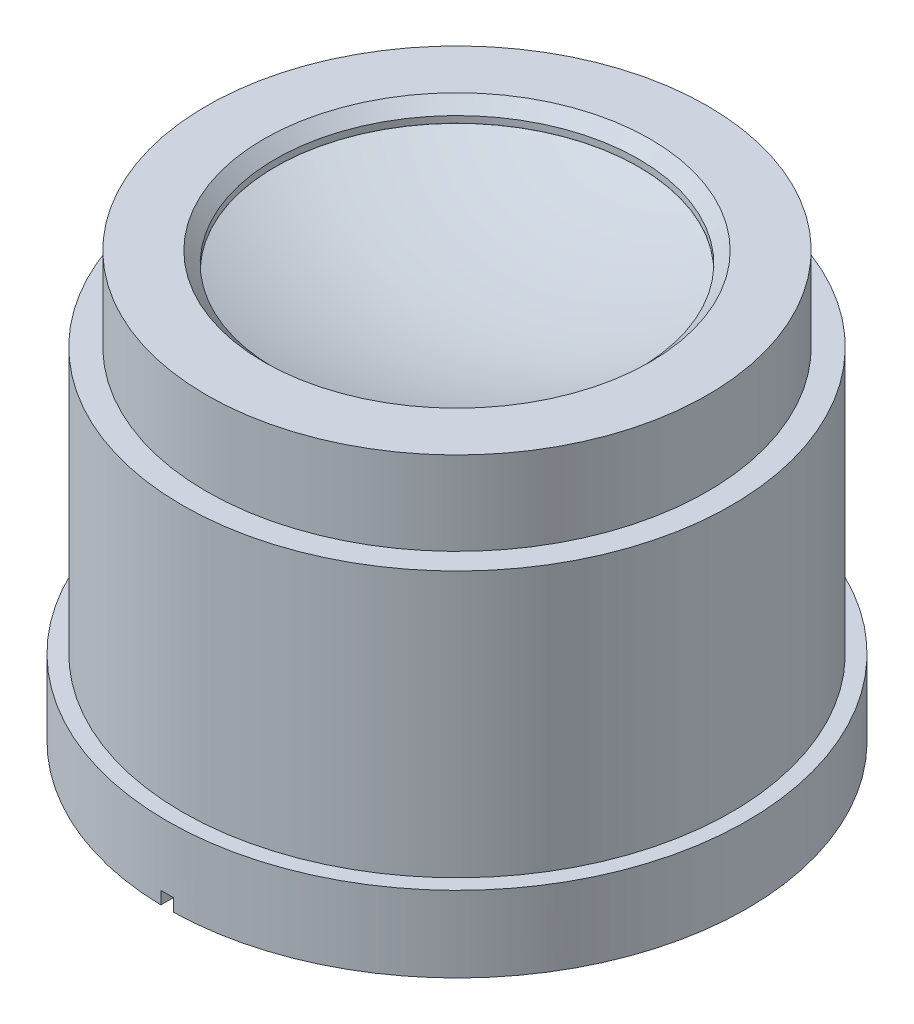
ISO-10303-21;
HEADER;
FILE_DESCRIPTION(('STEP AP214'),'2;1');
FILE_NAME('part.step','',(''),(''),'','','');
FILE_SCHEMA(('AUTOMOTIVE_DESIGN { 1 0 10303 214 1 1 1 1 }'));
ENDSEC;
DATA;
#1=APPLICATION_CONTEXT('core data for automotive mechanical design processes');
#2=APPLICATION_PROTOCOL_DEFINITION('international standard','automotive_design',2000,#1);
#3=PRODUCT_CONTEXT('',#1,'mechanical');
#4=PRODUCT('Part','Part','',(#3));
#5=PRODUCT_RELATED_PRODUCT_CATEGORY('part','',(#4));
#6=PRODUCT_DEFINITION_FORMATION('','',#4);
#7=PRODUCT_DEFINITION_CONTEXT('part definition',#1,'design');
#8=PRODUCT_DEFINITION('design','',#6,#7);
#9=PRODUCT_DEFINITION_SHAPE('','',#8);
#10=(LENGTH_UNIT() NAMED_UNIT(*) SI_UNIT(.MILLI.,.METRE.));
#11=(NAMED_UNIT(*) PLANE_ANGLE_UNIT() SI_UNIT($,.RADIAN.));
#12=(NAMED_UNIT(*) SI_UNIT($,.STERADIAN.) SOLID_ANGLE_UNIT());
#13=UNCERTAINTY_MEASURE_WITH_UNIT(LENGTH_MEASURE(1.E-05),#10,'distance_accuracy_value','');
#14=(GEOMETRIC_REPRESENTATION_CONTEXT(3) GLOBAL_UNCERTAINTY_ASSIGNED_CONTEXT((#13)) GLOBAL_UNIT_ASSIGNED_CONTEXT((#10,
#11,#12)) REPRESENTATION_CONTEXT('',''));
#15=CARTESIAN_POINT('',(0.,0.,0.));
#16=DIRECTION('',(0.,0.,1.));
#17=DIRECTION('',(1.,0.,0.));
#18=AXIS2_PLACEMENT_3D('',#15,#16,#17);
#19=CARTESIAN_POINT('',(-145.850201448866,42.7391679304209,80.4269664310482));
#20=DIRECTION('',(0.,-1.,0.));
#21=DIRECTION('',(0.,0.,-1.));
#22=AXIS2_PLACEMENT_3D('',#19,#20,#21);
#23=CYLINDRICAL_SURFACE('',#22,11.9634);
#24=CARTESIAN_POINT('',(-145.850201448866,7.69506286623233,80.4269664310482));
#25=DIRECTION('',(0.,1.,0.));
#26=DIRECTION('',(0.,0.,1.));
#27=AXIS2_PLACEMENT_3D('',#24,#25,#26);
#28=CIRCLE('',#27,11.9634);
#29=CARTESIAN_POINT('',(-145.850201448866,7.69506286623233,92.3903664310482));
#30=VERTEX_POINT('',#29);
#31=EDGE_CURVE('P0_E10',#30,#30,#28,.T.);
#32=ORIENTED_EDGE('',*,*,#31,.T.);
#33=EDGE_LOOP('',(#32));
#34=FACE_BOUND('',#33,.T.);
#35=CARTESIAN_POINT('',(-145.850201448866,7.70776286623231,80.4269664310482));
#36=DIRECTION('',(0.,1.,0.));
#37=DIRECTION('',(0.,0.,1.));
#38=AXIS2_PLACEMENT_3D('',#35,#36,#37);
#39=CIRCLE('',#38,11.9634);
#40=CARTESIAN_POINT('',(-145.850201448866,7.70776286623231,92.3903664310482));
#41=VERTEX_POINT('',#40);
#42=EDGE_CURVE('P0_E28',#41,#41,#39,.T.);
#43=ORIENTED_EDGE('',*,*,#42,.F.);
#44=EDGE_LOOP('',(#43));
#45=FACE_BOUND('',#44,.T.);
#46=ADVANCED_FACE('P0_F14',(#34,#45),#23,.T.);
#47=CARTESIAN_POINT('',(-145.850201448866,37.8562928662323,80.4269664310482));
#48=DIRECTION('',(0.,0.,1.));
#49=DIRECTION('',(1.,0.,0.));
#50=AXIS2_PLACEMENT_3D('',#47,#48,#49);
#51=SPHERICAL_SURFACE('',#50,32.44723);
#52=CARTESIAN_POINT('',(-145.850201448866,37.8562928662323,80.4269664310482));
#53=DIRECTION('',(0.,1.,0.));
#54=DIRECTION('',(0.,0.,1.));
#55=AXIS2_PLACEMENT_3D('',#52,#53,#54);
#56=SPHERICAL_SURFACE('',#55,32.44723);
#57=ORIENTED_EDGE('',*,*,#31,.F.);
#58=EDGE_LOOP('',(#57));
#59=FACE_BOUND('',#58,.T.);
#60=ADVANCED_FACE('P0_F16',(#59),#56,.T.);
#61=CARTESIAN_POINT('',(-145.850201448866,7.70776286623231,80.4269664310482));
#62=DIRECTION('',(0.,1.,0.));
#63=DIRECTION('',(0.,0.,1.));
#64=AXIS2_PLACEMENT_3D('',#61,#62,#63);
#65=PLANE('',#64);
#66=CARTESIAN_POINT('',(-145.850201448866,7.70776286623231,80.4269664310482));
#67=DIRECTION('',(0.,1.,0.));
#68=DIRECTION('',(0.,0.,1.));
#69=AXIS2_PLACEMENT_3D('',#66,#67,#68);
#70=CIRCLE('',#69,11.96086);
#71=CARTESIAN_POINT('',(-145.850201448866,7.70776286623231,92.3878264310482));
#72=VERTEX_POINT('',#71);
#73=EDGE_CURVE('P0_E18',#72,#72,#70,.T.);
#74=ORIENTED_EDGE('',*,*,#73,.F.);
#75=EDGE_LOOP('',(#74));
#76=FACE_BOUND('',#75,.T.);
#77=ORIENTED_EDGE('',*,*,#42,.T.);
#78=EDGE_LOOP('',(#77));
#79=FACE_BOUND('',#78,.T.);
#80=ADVANCED_FACE('P0_F37',(#76,#79),#65,.T.);
#81=CARTESIAN_POINT('',(-145.850201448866,37.8562928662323,80.4269664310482));
#82=DIRECTION('',(0.,0.,1.));
#83=DIRECTION('',(1.,0.,0.));
#84=AXIS2_PLACEMENT_3D('',#81,#82,#83);
#85=SPHERICAL_SURFACE('',#84,32.44469);
#86=CARTESIAN_POINT('',(-145.850201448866,37.8562928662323,80.4269664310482));
#87=DIRECTION('',(0.,1.,0.));
#88=DIRECTION('',(0.,0.,1.));
#89=AXIS2_PLACEMENT_3D('',#86,#87,#88);
#90=SPHERICAL_SURFACE('',#89,32.44469);
#91=CARTESIAN_POINT('',(-145.850201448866,7.69678794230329,80.4269664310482));
#92=DIRECTION('',(0.,1.,0.));
#93=DIRECTION('',(0.,0.,1.));
#94=AXIS2_PLACEMENT_3D('',#91,#92,#93);
#95=CIRCLE('',#94,11.96086);
#96=CARTESIAN_POINT('',(-145.850201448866,7.69678794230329,92.3878264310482));
#97=VERTEX_POINT('',#96);
#98=EDGE_CURVE('P0_E22',#97,#97,#95,.T.);
#99=ORIENTED_EDGE('',*,*,#98,.T.);
#100=EDGE_LOOP('',(#99));
#101=FACE_BOUND('',#100,.T.);
#102=ADVANCED_FACE('P0_F39',(#101),#90,.F.);
#103=CARTESIAN_POINT('',(-145.850201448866,42.7391679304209,80.4269664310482));
#104=DIRECTION('',(0.,-1.,0.));
#105=DIRECTION('',(0.,0.,-1.));
#106=AXIS2_PLACEMENT_3D('',#103,#104,#105);
#107=CYLINDRICAL_SURFACE('',#106,11.96086);
#108=ORIENTED_EDGE('',*,*,#98,.F.);
#109=EDGE_LOOP('',(#108));
#110=FACE_BOUND('',#109,.T.);
#111=ORIENTED_EDGE('',*,*,#73,.T.);
#112=EDGE_LOOP('',(#111));
#113=FACE_BOUND('',#112,.T.);
#114=ADVANCED_FACE('P0_F35',(#110,#113),#107,.F.);
#115=CLOSED_SHELL('',(#46,#60,#80,#102,#114));
#116=MANIFOLD_SOLID_BREP('P0_B1',#115);
#117=CARTESIAN_POINT('',(-145.850201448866,-19.0984371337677,80.4269664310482));
#118=DIRECTION('',(0.,1.,0.));
#119=DIRECTION('',(0.,0.,1.));
#120=AXIS2_PLACEMENT_3D('',#117,#118,#119);
#121=PLANE('',#120);
#122=CARTESIAN_POINT('',(-145.850201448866,-19.0984371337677,80.4269664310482));
#123=DIRECTION('',(0.,1.,0.));
#124=DIRECTION('',(0.,0.,1.));
#125=AXIS2_PLACEMENT_3D('',#122,#123,#124);
#126=CIRCLE('',#125,19.100000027);
#127=CARTESIAN_POINT('',(-146.269301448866,-19.0984371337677,61.3315649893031));
#128=VERTEX_POINT('',#127);
#129=CARTESIAN_POINT('',(-146.269301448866,-19.0984371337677,99.5223678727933));
#130=VERTEX_POINT('',#129);
#131=EDGE_CURVE('P1_E103',#128,#130,#126,.T.);
#132=ORIENTED_EDGE('',*,*,#131,.F.);
#133=DIRECTION('',(0.,0.,1.));
#134=VECTOR('',#133,1.);
#135=CARTESIAN_POINT('',(-146.269301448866,-19.0984371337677,61.3269664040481));
#136=LINE('',#135,#134);
#137=CARTESIAN_POINT('',(-146.269301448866,-19.0984371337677,63.1346443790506));
#138=VERTEX_POINT('',#137);
#139=EDGE_CURVE('P1_E174',#128,#138,#136,.T.);
#140=ORIENTED_EDGE('',*,*,#139,.T.);
#141=CARTESIAN_POINT('',(-145.850201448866,-19.0984371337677,80.4269664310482));
#142=DIRECTION('',(0.,1.,0.));
#143=DIRECTION('',(0.,0.,1.));
#144=AXIS2_PLACEMENT_3D('',#141,#142,#143);
#145=CIRCLE('',#144,17.2974);
#146=CARTESIAN_POINT('',(-146.269301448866,-19.0984371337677,97.7192884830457));
#147=VERTEX_POINT('',#146);
#148=EDGE_CURVE('P1_E106',#138,#147,#145,.T.);
#149=ORIENTED_EDGE('',*,*,#148,.T.);
#150=EDGE_CURVE('P1_E175',#147,#130,#136,.T.);
#151=ORIENTED_EDGE('',*,*,#150,.T.);
#152=EDGE_LOOP('',(#132,#140,#149,#151));
#153=FACE_BOUND('',#152,.T.);
#154=ADVANCED_FACE('P1_F16',(#153),#121,.F.);
#155=CARTESIAN_POINT('',(-145.431101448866,-19.0984371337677,99.5223678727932));
#156=VERTEX_POINT('',#155);
#157=CARTESIAN_POINT('',(-145.431101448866,-19.0984371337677,61.3315649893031));
#158=VERTEX_POINT('',#157);
#159=EDGE_CURVE('P1_E95',#156,#158,#126,.T.);
#160=ORIENTED_EDGE('',*,*,#159,.F.);
#161=DIRECTION('',(0.,0.,1.));
#162=VECTOR('',#161,1.);
#163=CARTESIAN_POINT('',(-145.431101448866,-19.0984371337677,61.3269664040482));
#164=LINE('',#163,#162);
#165=CARTESIAN_POINT('',(-145.431101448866,-19.0984371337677,97.7192884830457));
#166=VERTEX_POINT('',#165);
#167=EDGE_CURVE('P1_E98',#166,#156,#164,.T.);
#168=ORIENTED_EDGE('',*,*,#167,.F.);
#169=CARTESIAN_POINT('',(-145.431101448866,-19.0984371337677,63.1346443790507));
#170=VERTEX_POINT('',#169);
#171=EDGE_CURVE('P1_E97',#166,#170,#145,.T.);
#172=ORIENTED_EDGE('',*,*,#171,.T.);
#173=EDGE_CURVE('P1_E39',#158,#170,#164,.T.);
#174=ORIENTED_EDGE('',*,*,#173,.F.);
#175=EDGE_LOOP('',(#160,#168,#172,#174));
#176=FACE_BOUND('',#175,.T.);
#177=ADVANCED_FACE('P1_F93',(#176),#121,.F.);
#178=CARTESIAN_POINT('',(-145.850201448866,8.90156286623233,80.4269664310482));
#179=DIRECTION('',(0.,1.,0.));
#180=DIRECTION('',(0.,0.,1.));
#181=AXIS2_PLACEMENT_3D('',#178,#179,#180);
#182=CYLINDRICAL_SURFACE('',#181,19.100000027);
#183=CARTESIAN_POINT('',(-145.850201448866,-14.0984371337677,80.4269664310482));
#184=DIRECTION('',(0.,1.,0.));
#185=DIRECTION('',(0.,0.,1.));
#186=AXIS2_PLACEMENT_3D('',#183,#184,#185);
#187=CIRCLE('',#186,19.100000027);
#188=CARTESIAN_POINT('',(-145.850201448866,-14.0984371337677,99.5269664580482));
#189=VERTEX_POINT('',#188);
#190=EDGE_CURVE('P1_E109',#189,#189,#187,.T.);
#191=ORIENTED_EDGE('',*,*,#190,.F.);
#192=EDGE_LOOP('',(#191));
#193=FACE_BOUND('',#192,.T.);
#194=DIRECTION('',(0.,1.,0.));
#195=VECTOR('',#194,1.);
#196=CARTESIAN_POINT('',(-145.431101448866,8.90156286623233,61.3315649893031));
#197=LINE('',#196,#195);
#198=CARTESIAN_POINT('',(-145.431101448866,-18.2602371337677,61.3315649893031));
#199=VERTEX_POINT('',#198);
#200=EDGE_CURVE('P1_E81',#158,#199,#197,.T.);
#201=ORIENTED_EDGE('',*,*,#200,.T.);
#202=CARTESIAN_POINT('',(-145.850201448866,-18.2602371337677,80.4269664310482));
#203=DIRECTION('',(0.,1.,0.));
#204=DIRECTION('',(0.,0.,1.));
#205=AXIS2_PLACEMENT_3D('',#202,#203,#204);
#206=CIRCLE('',#205,19.100000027);
#207=CARTESIAN_POINT('',(-146.269301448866,-18.2602371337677,61.3315649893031));
#208=VERTEX_POINT('',#207);
#209=EDGE_CURVE('P1_E185',#199,#208,#206,.T.);
#210=ORIENTED_EDGE('',*,*,#209,.T.);
#211=DIRECTION('',(0.,1.,0.));
#212=VECTOR('',#211,1.);
#213=CARTESIAN_POINT('',(-146.269301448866,8.90156286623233,61.3315649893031));
#214=LINE('',#213,#212);
#215=EDGE_CURVE('P1_E186',#208,#128,#214,.F.);
#216=ORIENTED_EDGE('',*,*,#215,.T.);
#217=ORIENTED_EDGE('',*,*,#131,.T.);
#218=DIRECTION('',(0.,1.,0.));
#219=VECTOR('',#218,1.);
#220=CARTESIAN_POINT('',(-146.269301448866,8.90156286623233,99.5223678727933));
#221=LINE('',#220,#219);
#222=CARTESIAN_POINT('',(-146.269301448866,-18.2602371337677,99.5223678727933));
#223=VERTEX_POINT('',#222);
#224=EDGE_CURVE('P1_E153',#130,#223,#221,.T.);
#225=ORIENTED_EDGE('',*,*,#224,.T.);
#226=CARTESIAN_POINT('',(-145.431101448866,-18.2602371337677,99.5223678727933));
#227=VERTEX_POINT('',#226);
#228=EDGE_CURVE('P1_E87',#223,#227,#206,.T.);
#229=ORIENTED_EDGE('',*,*,#228,.T.);
#230=DIRECTION('',(0.,1.,0.));
#231=VECTOR('',#230,1.);
#232=CARTESIAN_POINT('',(-145.431101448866,8.90156286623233,99.5223678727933));
#233=LINE('',#232,#231);
#234=EDGE_CURVE('P1_E88',#227,#156,#233,.F.);
#235=ORIENTED_EDGE('',*,*,#234,.T.);
#236=ORIENTED_EDGE('',*,*,#159,.T.);
#237=EDGE_LOOP('',(#201,#210,#216,#217,#225,#229,#235,#236));
#238=FACE_BOUND('',#237,.T.);
#239=ADVANCED_FACE('P1_F101',(#193,#238),#182,.T.);
#240=CARTESIAN_POINT('',(-126.750201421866,-14.0984371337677,80.4269664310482));
#241=DIRECTION('',(0.,-1.,0.));
#242=DIRECTION('',(0.,0.,-1.));
#243=AXIS2_PLACEMENT_3D('',#240,#241,#242);
#244=PLANE('',#243);
#245=CARTESIAN_POINT('',(-145.850201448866,-14.0984371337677,80.4269664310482));
#246=DIRECTION('',(0.,1.,0.));
#247=DIRECTION('',(0.,0.,1.));
#248=AXIS2_PLACEMENT_3D('',#245,#246,#247);
#249=CIRCLE('',#248,18.085);
#250=CARTESIAN_POINT('',(-145.850201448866,-14.0984371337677,98.5119664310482));
#251=VERTEX_POINT('',#250);
#252=EDGE_CURVE('P1_E198',#251,#251,#249,.T.);
#253=ORIENTED_EDGE('',*,*,#252,.F.);
#254=EDGE_LOOP('',(#253));
#255=FACE_BOUND('',#254,.T.);
#256=ORIENTED_EDGE('',*,*,#190,.T.);
#257=EDGE_LOOP('',(#256));
#258=FACE_BOUND('',#257,.T.);
#259=ADVANCED_FACE('P1_F205',(#255,#258),#244,.F.);
#260=CARTESIAN_POINT('',(-145.850201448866,8.90156286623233,80.4269664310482));
#261=DIRECTION('',(0.,1.,0.));
#262=DIRECTION('',(0.,0.,1.));
#263=AXIS2_PLACEMENT_3D('',#260,#261,#262);
#264=CYLINDRICAL_SURFACE('',#263,18.085);
#265=CARTESIAN_POINT('',(-145.850201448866,3.40156286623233,80.4269664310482));
#266=DIRECTION('',(0.,1.,0.));
#267=DIRECTION('',(0.,0.,1.));
#268=AXIS2_PLACEMENT_3D('',#265,#266,#267);
#269=CIRCLE('',#268,18.085);
#270=CARTESIAN_POINT('',(-145.850201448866,3.40156286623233,98.5119664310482));
#271=VERTEX_POINT('',#270);
#272=EDGE_CURVE('P1_E196',#271,#271,#269,.T.);
#273=ORIENTED_EDGE('',*,*,#272,.F.);
#274=EDGE_LOOP('',(#273));
#275=FACE_BOUND('',#274,.T.);
#276=ORIENTED_EDGE('',*,*,#252,.T.);
#277=EDGE_LOOP('',(#276));
#278=FACE_BOUND('',#277,.T.);
#279=ADVANCED_FACE('P1_F214',(#275,#278),#264,.T.);
#280=CARTESIAN_POINT('',(-129.350201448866,3.40156286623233,80.4269664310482));
#281=DIRECTION('',(0.,-1.,0.));
#282=DIRECTION('',(0.,0.,-1.));
#283=AXIS2_PLACEMENT_3D('',#280,#281,#282);
#284=PLANE('',#283);
#285=CARTESIAN_POINT('',(-145.850201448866,3.40156286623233,80.4269664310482));
#286=DIRECTION('',(0.,1.,0.));
#287=DIRECTION('',(0.,0.,1.));
#288=AXIS2_PLACEMENT_3D('',#285,#286,#287);
#289=CIRCLE('',#288,16.5);
#290=CARTESIAN_POINT('',(-145.850201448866,3.40156286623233,96.9269664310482));
#291=VERTEX_POINT('',#290);
#292=EDGE_CURVE('P1_E193',#291,#291,#289,.T.);
#293=ORIENTED_EDGE('',*,*,#292,.F.);
#294=EDGE_LOOP('',(#293));
#295=FACE_BOUND('',#294,.T.);
#296=ORIENTED_EDGE('',*,*,#272,.T.);
#297=EDGE_LOOP('',(#296));
#298=FACE_BOUND('',#297,.T.);
#299=ADVANCED_FACE('P1_F412',(#295,#298),#284,.F.);
#300=CARTESIAN_POINT('',(-145.850201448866,8.90156286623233,80.4269664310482));
#301=DIRECTION('',(0.,1.,0.));
#302=DIRECTION('',(0.,0.,1.));
#303=AXIS2_PLACEMENT_3D('',#300,#301,#302);
#304=CYLINDRICAL_SURFACE('',#303,16.5);
#305=CARTESIAN_POINT('',(-145.850201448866,8.90156286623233,80.4269664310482));
#306=DIRECTION('',(0.,1.,0.));
#307=DIRECTION('',(0.,0.,1.));
#308=AXIS2_PLACEMENT_3D('',#305,#306,#307);
#309=CIRCLE('',#308,16.5);
#310=CARTESIAN_POINT('',(-145.850201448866,8.90156286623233,96.9269664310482));
#311=VERTEX_POINT('',#310);
#312=EDGE_CURVE('P1_E152',#311,#311,#309,.T.);
#313=ORIENTED_EDGE('',*,*,#312,.F.);
#314=EDGE_LOOP('',(#313));
#315=FACE_BOUND('',#314,.T.);
#316=ORIENTED_EDGE('',*,*,#292,.T.);
#317=EDGE_LOOP('',(#316));
#318=FACE_BOUND('',#317,.T.);
#319=ADVANCED_FACE('P1_F402',(#315,#318),#304,.T.);
#320=CARTESIAN_POINT('',(-129.350201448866,8.90156286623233,80.4269664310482));
#321=DIRECTION('',(0.,-1.,0.));
#322=DIRECTION('',(0.,0.,-1.));
#323=AXIS2_PLACEMENT_3D('',#320,#321,#322);
#324=PLANE('',#323);
#325=CARTESIAN_POINT('',(-145.850201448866,8.90156286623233,80.4269664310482));
#326=DIRECTION('',(0.,-1.,0.));
#327=DIRECTION('',(0.,0.,-1.));
#328=AXIS2_PLACEMENT_3D('',#325,#326,#327);
#329=CIRCLE('',#328,12.7254);
#330=CARTESIAN_POINT('',(-145.850201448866,8.90156286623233,67.7015664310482));
#331=VERTEX_POINT('',#330);
#332=EDGE_CURVE('P1_E11',#331,#331,#329,.T.);
#333=ORIENTED_EDGE('',*,*,#332,.T.);
#334=EDGE_LOOP('',(#333));
#335=FACE_BOUND('',#334,.T.);
#336=ORIENTED_EDGE('',*,*,#312,.T.);
#337=EDGE_LOOP('',(#336));
#338=FACE_BOUND('',#337,.T.);
#339=ADVANCED_FACE('P1_F392',(#335,#338),#324,.F.);
#340=CARTESIAN_POINT('',(-145.850201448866,-16.6092371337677,80.4269664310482));
#341=DIRECTION('',(0.,-1.,0.));
#342=DIRECTION('',(0.,0.,-1.));
#343=AXIS2_PLACEMENT_3D('',#340,#341,#342);
#344=CYLINDRICAL_SURFACE('',#343,15.0114);
#345=CARTESIAN_POINT('',(-145.850201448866,-16.8124371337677,80.4269664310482));
#346=DIRECTION('',(0.,1.,0.));
#347=DIRECTION('',(0.,0.,1.));
#348=AXIS2_PLACEMENT_3D('',#345,#346,#347);
#349=CIRCLE('',#348,15.0114);
#350=CARTESIAN_POINT('',(-145.850201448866,-16.8124371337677,95.4383664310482));
#351=VERTEX_POINT('',#350);
#352=EDGE_CURVE('P1_E102',#351,#351,#349,.F.);
#353=ORIENTED_EDGE('',*,*,#352,.T.);
#354=EDGE_LOOP('',(#353));
#355=FACE_BOUND('',#354,.T.);
#356=CARTESIAN_POINT('',(-145.850201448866,-16.6092371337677,80.4269664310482));
#357=DIRECTION('',(0.,-1.,0.));
#358=DIRECTION('',(0.,0.,-1.));
#359=AXIS2_PLACEMENT_3D('',#356,#357,#358);
#360=CIRCLE('',#359,15.0114);
#361=CARTESIAN_POINT('',(-145.850201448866,-16.6092371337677,65.4155664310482));
#362=VERTEX_POINT('',#361);
#363=EDGE_CURVE('P1_E150',#362,#362,#360,.T.);
#364=ORIENTED_EDGE('',*,*,#363,.F.);
#365=EDGE_LOOP('',(#364));
#366=FACE_BOUND('',#365,.T.);
#367=ADVANCED_FACE('P1_F142',(#355,#366),#344,.F.);
#368=CARTESIAN_POINT('',(-145.850201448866,31.5351928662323,80.4269664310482));
#369=DIRECTION('',(0.,0.,1.));
#370=DIRECTION('',(1.,0.,0.));
#371=AXIS2_PLACEMENT_3D('',#368,#369,#370);
#372=SPHERICAL_SURFACE('',#371,50.43043);
#373=CARTESIAN_POINT('',(-145.850201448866,31.5351928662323,80.4269664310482));
#374=DIRECTION('',(0.,-1.,0.));
#375=DIRECTION('',(0.,0.,-1.));
#376=AXIS2_PLACEMENT_3D('',#373,#374,#375);
#377=SPHERICAL_SURFACE('',#376,50.43043);
#378=ORIENTED_EDGE('',*,*,#363,.T.);
#379=EDGE_LOOP('',(#378));
#380=FACE_BOUND('',#379,.T.);
#381=ADVANCED_FACE('P1_F374',(#380),#377,.T.);
#382=CARTESIAN_POINT('',(-145.850201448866,-16.8124371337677,80.4269664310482));
#383=DIRECTION('',(0.,-1.,0.));
#384=DIRECTION('',(0.,0.,-1.));
#385=AXIS2_PLACEMENT_3D('',#382,#383,#384);
#386=CONICAL_SURFACE('',#385,15.0114,0.785398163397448);
#387=CARTESIAN_POINT('',(-146.269301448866,-39.8616088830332,118.485230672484));
#388=CARTESIAN_POINT('',(-146.269301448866,-38.5480580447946,117.171599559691));
#389=CARTESIAN_POINT('',(-146.269301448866,-37.2345107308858,115.857964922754));
#390=CARTESIAN_POINT('',(-146.269301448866,-34.6074276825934,113.230684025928));
#391=CARTESIAN_POINT('',(-146.269301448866,-33.29389194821,111.917037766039));
#392=CARTESIAN_POINT('',(-146.269301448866,-30.6668361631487,109.289728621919));
#393=CARTESIAN_POINT('',(-146.269301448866,-29.3533161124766,107.976065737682));
#394=CARTESIAN_POINT('',(-146.269301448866,-26.7263007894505,105.34871523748));
#395=CARTESIAN_POINT('',(-146.269301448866,-25.4128055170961,104.035027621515));
#396=CARTESIAN_POINT('',(-146.269301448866,-22.7855026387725,101.407261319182));
#397=CARTESIAN_POINT('',(-146.269301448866,-21.4716950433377,100.093182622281));
#398=CARTESIAN_POINT('',(-146.269301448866,-18.8441517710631,97.4649532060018));
#399=CARTESIAN_POINT('',(-146.269301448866,-17.5304160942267,96.1508024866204));
#400=CARTESIAN_POINT('',(-146.269301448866,-14.9030805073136,93.5223658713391));
#401=CARTESIAN_POINT('',(-146.269301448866,-13.5894805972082,92.2080799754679));
#402=CARTESIAN_POINT('',(-146.269301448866,-11.6193594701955,90.2363727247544));
#403=CARTESIAN_POINT('',(-146.269301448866,-10.9626989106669,89.5790905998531));
#404=CARTESIAN_POINT('',(-146.269301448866,-9.64955086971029,88.2643534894));
#405=CARTESIAN_POINT('',(-146.269301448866,-8.99306338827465,87.6068985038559));
#406=CARTESIAN_POINT('',(-146.269301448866,-7.97694719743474,86.5886814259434));
#407=CARTESIAN_POINT('',(-146.269301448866,-7.6171821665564,86.2280553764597));
#408=CARTESIAN_POINT('',(-146.269301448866,-6.89786578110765,85.5066134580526));
#409=CARTESIAN_POINT('',(-146.269301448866,-6.53831441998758,85.1457975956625));
#410=CARTESIAN_POINT('',(-146.269301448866,-5.93855910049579,84.5432712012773));
#411=CARTESIAN_POINT('',(-146.269301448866,-5.6982455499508,84.301669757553));
#412=CARTESIAN_POINT('',(-146.269301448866,-5.21790536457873,83.8181517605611));
#413=CARTESIAN_POINT('',(-146.269301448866,-4.97787874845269,83.5762351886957));
#414=CARTESIAN_POINT('',(-146.269301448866,-4.57775990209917,83.171974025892));
#415=CARTESIAN_POINT('',(-146.269301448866,-4.41750335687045,83.0097920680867));
#416=CARTESIAN_POINT('',(-146.269301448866,-4.09747246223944,82.6850107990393));
#417=CARTESIAN_POINT('',(-146.269301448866,-3.93769802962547,82.5224115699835));
#418=CARTESIAN_POINT('',(-146.269301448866,-3.67179432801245,82.2503176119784));
#419=CARTESIAN_POINT('',(-146.269301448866,-3.56541793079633,82.1410644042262));
#420=CARTESIAN_POINT('',(-146.269301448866,-3.35328580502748,81.9218327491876));
#421=CARTESIAN_POINT('',(-146.269301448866,-3.24753046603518,81.8118539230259));
#422=CARTESIAN_POINT('',(-146.269301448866,-3.07208854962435,81.6271540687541));
#423=CARTESIAN_POINT('',(-146.269301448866,-3.00202823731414,81.5527881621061));
#424=CARTESIAN_POINT('',(-146.269301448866,-2.86306622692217,81.4032106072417));
#425=CARTESIAN_POINT('',(-146.269301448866,-2.79416273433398,81.3280006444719));
#426=CARTESIAN_POINT('',(-146.269301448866,-2.68088653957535,81.2009243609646));
#427=CARTESIAN_POINT('',(-146.269301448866,-2.6359414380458,81.1495690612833));
#428=CARTESIAN_POINT('',(-146.269301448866,-2.54740908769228,81.0452051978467));
#429=CARTESIAN_POINT('',(-146.269301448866,-2.50383023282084,80.9921893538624));
#430=CARTESIAN_POINT('',(-146.269301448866,-2.44066495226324,80.9104674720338));
#431=CARTESIAN_POINT('',(-146.269301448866,-2.41986949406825,80.8827025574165));
#432=CARTESIAN_POINT('',(-146.269301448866,-2.3795244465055,80.8262128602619));
#433=CARTESIAN_POINT('',(-146.269301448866,-2.35997655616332,80.7974868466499));
#434=CARTESIAN_POINT('',(-146.269301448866,-2.32303789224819,80.7389798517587));
#435=CARTESIAN_POINT('',(-146.269301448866,-2.30563111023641,80.709209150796));
#436=CARTESIAN_POINT('',(-146.269301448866,-2.27412650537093,80.6479984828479));
#437=CARTESIAN_POINT('',(-146.269301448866,-2.26001846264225,80.6165640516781));
#438=CARTESIAN_POINT('',(-146.269301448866,-2.23993945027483,80.5593468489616));
#439=CARTESIAN_POINT('',(-146.269301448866,-2.23283429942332,80.5339785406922));
#440=CARTESIAN_POINT('',(-146.269301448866,-2.22304600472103,80.4824521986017));
#441=CARTESIAN_POINT('',(-146.269301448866,-2.2203454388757,80.4562976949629));
#442=CARTESIAN_POINT('',(-146.269301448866,-2.21995177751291,80.4038383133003));
#443=CARTESIAN_POINT('',(-146.269301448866,-2.22227976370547,80.3775332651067));
#444=CARTESIAN_POINT('',(-146.269301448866,-2.23143796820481,80.3256766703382));
#445=CARTESIAN_POINT('',(-146.269301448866,-2.23828417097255,80.3001281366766));
#446=CARTESIAN_POINT('',(-146.269301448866,-2.2558511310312,80.2485236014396));
#447=CARTESIAN_POINT('',(-146.269301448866,-2.26680200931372,80.2225495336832));
#448=CARTESIAN_POINT('',(-146.269301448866,-2.29120639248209,80.17178476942));
#449=CARTESIAN_POINT('',(-146.269301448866,-2.30466468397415,80.1469964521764));
#450=CARTESIAN_POINT('',(-146.269301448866,-2.33332859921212,80.0982090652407));
#451=CARTESIAN_POINT('',(-146.269301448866,-2.34854702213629,80.0742176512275));
#452=CARTESIAN_POINT('',(-146.269301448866,-2.3800882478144,80.0270131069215));
#453=CARTESIAN_POINT('',(-146.269301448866,-2.39641003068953,80.0037992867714));
#454=CARTESIAN_POINT('',(-146.269301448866,-2.43140444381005,79.9557835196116));
#455=CARTESIAN_POINT('',(-146.269301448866,-2.45015372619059,79.9310378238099));
#456=CARTESIAN_POINT('',(-146.269301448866,-2.48830680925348,79.8820545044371));
#457=CARTESIAN_POINT('',(-146.269301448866,-2.50771069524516,79.8578169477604));
#458=CARTESIAN_POINT('',(-146.269301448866,-2.56663907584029,79.7856542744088));
#459=CARTESIAN_POINT('',(-146.269301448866,-2.60686299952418,79.7383020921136));
#460=CARTESIAN_POINT('',(-146.269301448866,-2.6884298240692,79.6444374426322));
#461=CARTESIAN_POINT('',(-146.269301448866,-2.72977456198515,79.597926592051));
#462=CARTESIAN_POINT('',(-146.269301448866,-2.81311934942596,79.5055201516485));
#463=CARTESIAN_POINT('',(-146.269301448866,-2.85511921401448,79.4596243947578));
#464=CARTESIAN_POINT('',(-146.269301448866,-2.9394224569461,79.3683928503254));
#465=CARTESIAN_POINT('',(-146.269301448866,-2.98172438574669,79.3230557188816));
#466=CARTESIAN_POINT('',(-146.269301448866,-3.06664062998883,79.2326693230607));
#467=CARTESIAN_POINT('',(-146.269301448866,-3.10925496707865,79.1876200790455));
#468=CARTESIAN_POINT('',(-146.269301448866,-3.23733982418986,79.0528828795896));
#469=CARTESIAN_POINT('',(-146.269301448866,-3.32314130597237,78.9635098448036));
#470=CARTESIAN_POINT('',(-146.269301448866,-3.49488504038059,78.7856253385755));
#471=CARTESIAN_POINT('',(-146.269301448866,-3.58082518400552,78.6971118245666));
#472=CARTESIAN_POINT('',(-146.269301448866,-3.75302602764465,78.5203969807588));
#473=CARTESIAN_POINT('',(-146.269301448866,-3.83928672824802,78.4321956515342));
#474=CARTESIAN_POINT('',(-146.269301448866,-4.09838650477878,78.1678967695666));
#475=CARTESIAN_POINT('',(-146.269301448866,-4.27153999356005,77.9921076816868));
#476=CARTESIAN_POINT('',(-146.269301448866,-4.6183417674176,77.6408742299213));
#477=CARTESIAN_POINT('',(-146.269301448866,-4.79199022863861,77.4654300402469));
#478=CARTESIAN_POINT('',(-146.269301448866,-5.13953895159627,77.1147941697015));
#479=CARTESIAN_POINT('',(-146.269301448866,-5.31343921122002,76.939602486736));
#480=CARTESIAN_POINT('',(-146.269301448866,-5.83543361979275,76.4141961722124));
#481=CARTESIAN_POINT('',(-146.269301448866,-6.18375997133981,76.0642123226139));
#482=CARTESIAN_POINT('',(-146.269301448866,-6.8806525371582,75.3645804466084));
#483=CARTESIAN_POINT('',(-146.269301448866,-7.22921871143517,75.0149323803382));
#484=CARTESIAN_POINT('',(-146.269301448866,-8.27505868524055,73.9663178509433));
#485=CARTESIAN_POINT('',(-146.269301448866,-8.97256813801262,73.2675864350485));
#486=CARTESIAN_POINT('',(-146.269301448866,-10.3678266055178,71.8703624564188));
#487=CARTESIAN_POINT('',(-146.269301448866,-11.0655756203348,71.1718698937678));
#488=CARTESIAN_POINT('',(-146.269301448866,-13.1590764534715,69.0765011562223));
#489=CARTESIAN_POINT('',(-146.269301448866,-14.5550097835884,67.6798063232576));
#490=CARTESIAN_POINT('',(-146.269301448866,-17.3468199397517,64.8867869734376));
#491=CARTESIAN_POINT('',(-146.269301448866,-18.7426967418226,63.4904624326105));
#492=CARTESIAN_POINT('',(-146.269301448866,-21.5345126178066,60.6979150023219));
#493=CARTESIAN_POINT('',(-146.269301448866,-22.9304516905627,59.301692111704));
#494=CARTESIAN_POINT('',(-146.269301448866,-25.6208814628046,56.6107977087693));
#495=CARTESIAN_POINT('',(-146.269301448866,-26.9153691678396,55.3161232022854));
#496=CARTESIAN_POINT('',(-146.269301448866,-29.5043742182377,52.7267919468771));
#497=CARTESIAN_POINT('',(-146.269301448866,-30.7988915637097,51.4321351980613));
#498=CARTESIAN_POINT('',(-146.269301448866,-33.3881056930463,48.8426732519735));
#499=CARTESIAN_POINT('',(-146.269301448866,-34.6828024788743,47.5478680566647));
#500=CARTESIAN_POINT('',(-146.269301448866,-37.2722013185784,44.9582748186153));
#501=CARTESIAN_POINT('',(-146.269301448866,-38.566903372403,43.6634867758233));
#502=CARTESIAN_POINT('',(-146.269301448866,-39.8616088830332,42.3687021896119));
#503=B_SPLINE_CURVE_WITH_KNOTS('',3,(#387,#388,#389,#390,#391,#392,#393,#394,#395,#396,#397,
#398,#399,#400,#401,#402,#403,#404,#405,#406,#407,#408,#409,#410,#411,#412,#413,#414,#415,#416,
#417,#418,#419,#420,#421,#422,#423,#424,#425,#426,#427,#428,#429,#430,#431,#432,#433,#434,#435,
#436,#437,#438,#439,#440,#441,#442,#443,#444,#445,#446,#447,#448,#449,#450,#451,#452,#453,#454,
#455,#456,#457,#458,#459,#460,#461,#462,#463,#464,#465,#466,#467,#468,#469,#470,#471,#472,#473,
#474,#475,#476,#477,#478,#479,#480,#481,#482,#483,#484,#485,#486,#487,#488,#489,#490,#491,#492,
#493,#494,#495,#496,#497,#498,#499,#500,#501,#502),.UNSPECIFIED.,.F.,.F.,(4,2,2,2,2,2,2,2,2,2,2,
2,2,2,2,2,2,2,2,2,2,2,2,2,2,2,2,2,2,2,2,2,2,2,2,2,2,2,2,2,2,2,2,2,2,2,2,2,2,2,2,2,2,2,2,2,2,4),
(0.,5.5730945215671,11.1461891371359,16.7192857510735,22.2923822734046,27.8669709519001,
33.4415598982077,39.0161476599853,41.803441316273,44.5907348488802,46.1189161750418,
47.6470479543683,48.669347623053,49.6917106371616,50.3757179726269,51.0595995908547,
51.517059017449,51.9747799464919,52.2812875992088,52.5872650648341,52.7919907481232,
52.9977941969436,53.1018399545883,53.2060245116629,53.3093754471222,53.4124018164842,
53.4911422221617,53.5695704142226,53.6483280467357,53.7273658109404,53.8117327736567,
53.8962624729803,53.981450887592,54.0665616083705,54.1596855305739,54.2528216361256,
54.4391799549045,54.625864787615,54.812497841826,54.9985180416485,55.1845512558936,
55.5562255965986,55.9263370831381,56.296449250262,57.0366876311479,57.7772345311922,
58.5177752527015,59.999118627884,61.4802564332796,64.442131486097,67.4040075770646,
73.3280666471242,79.251220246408,85.1742902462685,90.6667327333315,96.1592004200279,
101.652363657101,107.145501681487),.UNSPECIFIED.);
#504=CARTESIAN_POINT('',(-146.269301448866,-18.2602371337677,63.9731030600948));
#505=VERTEX_POINT('',#504);
#506=EDGE_CURVE('P1_E149',#505,#138,#503,.T.);
#507=ORIENTED_EDGE('',*,*,#506,.F.);
#508=CARTESIAN_POINT('',(-145.850201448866,-18.2602371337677,80.4269664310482));
#509=DIRECTION('',(0.,1.,0.));
#510=DIRECTION('',(0.,0.,1.));
#511=AXIS2_PLACEMENT_3D('',#508,#509,#510);
#512=CIRCLE('',#511,16.4592);
#513=CARTESIAN_POINT('',(-145.431101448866,-18.2602371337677,63.9731030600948));
#514=VERTEX_POINT('',#513);
#515=EDGE_CURVE('P1_E157',#514,#505,#512,.T.);
#516=ORIENTED_EDGE('',*,*,#515,.F.);
#517=CARTESIAN_POINT('',(-145.431101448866,-39.8616088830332,42.3687021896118));
#518=CARTESIAN_POINT('',(-145.431101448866,-38.5480580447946,43.682333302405));
#519=CARTESIAN_POINT('',(-145.431101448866,-37.2345107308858,44.9959679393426));
#520=CARTESIAN_POINT('',(-145.431101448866,-34.6074276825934,47.6232488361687));
#521=CARTESIAN_POINT('',(-145.431101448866,-33.29389194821,48.9368950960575));
#522=CARTESIAN_POINT('',(-145.431101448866,-30.6668361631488,51.5642042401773));
#523=CARTESIAN_POINT('',(-145.431101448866,-29.3533161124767,52.8778671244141));
#524=CARTESIAN_POINT('',(-145.431101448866,-26.7263007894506,55.5052176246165));
#525=CARTESIAN_POINT('',(-145.431101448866,-25.4128055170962,56.8189052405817));
#526=CARTESIAN_POINT('',(-145.431101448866,-22.7855026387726,59.4466715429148));
#527=CARTESIAN_POINT('',(-145.431101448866,-21.4716950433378,60.7607502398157));
#528=CARTESIAN_POINT('',(-145.431101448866,-18.8441517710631,63.3889796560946));
#529=CARTESIAN_POINT('',(-145.431101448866,-17.5304160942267,64.7031303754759));
#530=CARTESIAN_POINT('',(-145.431101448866,-14.9030805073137,67.3315669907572));
#531=CARTESIAN_POINT('',(-145.431101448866,-13.5894805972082,68.6458528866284));
#532=CARTESIAN_POINT('',(-145.431101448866,-11.6193594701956,70.6175601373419));
#533=CARTESIAN_POINT('',(-145.431101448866,-10.9626989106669,71.2748422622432));
#534=CARTESIAN_POINT('',(-145.431101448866,-9.64955086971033,72.5895793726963));
#535=CARTESIAN_POINT('',(-145.431101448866,-8.99306338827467,73.2470343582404));
#536=CARTESIAN_POINT('',(-145.431101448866,-7.97694719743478,74.2652514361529));
#537=CARTESIAN_POINT('',(-145.431101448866,-7.61718216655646,74.6258774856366));
#538=CARTESIAN_POINT('',(-145.431101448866,-6.89786578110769,75.3473194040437));
#539=CARTESIAN_POINT('',(-145.431101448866,-6.53831441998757,75.7081352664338));
#540=CARTESIAN_POINT('',(-145.431101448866,-5.9385591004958,76.310661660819));
#541=CARTESIAN_POINT('',(-145.431101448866,-5.69824554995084,76.5522631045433));
#542=CARTESIAN_POINT('',(-145.431101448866,-5.21790536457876,77.0357811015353));
#543=CARTESIAN_POINT('',(-145.431101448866,-4.97787874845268,77.2776976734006));
#544=CARTESIAN_POINT('',(-145.431101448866,-4.57775990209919,77.6819588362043));
#545=CARTESIAN_POINT('',(-145.431101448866,-4.4175033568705,77.8441407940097));
#546=CARTESIAN_POINT('',(-145.431101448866,-4.09747246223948,78.168922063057));
#547=CARTESIAN_POINT('',(-145.431101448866,-3.93769802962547,78.3315212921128));
#548=CARTESIAN_POINT('',(-145.431101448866,-3.67179432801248,78.603615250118));
#549=CARTESIAN_POINT('',(-145.431101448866,-3.5654179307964,78.7128684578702));
#550=CARTESIAN_POINT('',(-145.431101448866,-3.35328580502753,78.9321001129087));
#551=CARTESIAN_POINT('',(-145.431101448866,-3.24753046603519,79.0420789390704));
#552=CARTESIAN_POINT('',(-145.431101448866,-3.07208854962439,79.2267787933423));
#553=CARTESIAN_POINT('',(-145.431101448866,-3.00202823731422,79.3011446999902));
#554=CARTESIAN_POINT('',(-145.431101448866,-2.86306622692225,79.4507222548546));
#555=CARTESIAN_POINT('',(-145.431101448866,-2.79416273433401,79.5259322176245));
#556=CARTESIAN_POINT('',(-145.431101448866,-2.68088653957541,79.6530085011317));
#557=CARTESIAN_POINT('',(-145.431101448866,-2.6359414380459,79.7043638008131));
#558=CARTESIAN_POINT('',(-145.431101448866,-2.54740908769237,79.8087276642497));
#559=CARTESIAN_POINT('',(-145.431101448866,-2.50383023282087,79.8617435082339));
#560=CARTESIAN_POINT('',(-145.431101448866,-2.44066495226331,79.9434653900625));
#561=CARTESIAN_POINT('',(-145.431101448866,-2.41986949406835,79.9712303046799));
#562=CARTESIAN_POINT('',(-145.431101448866,-2.37952444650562,80.0277200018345));
#563=CARTESIAN_POINT('',(-145.431101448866,-2.35997655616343,80.0564460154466));
#564=CARTESIAN_POINT('',(-145.431101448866,-2.32303789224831,80.1149530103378));
#565=CARTESIAN_POINT('',(-145.431101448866,-2.30563111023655,80.1447237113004));
#566=CARTESIAN_POINT('',(-145.431101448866,-2.27412650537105,80.2059343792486));
#567=CARTESIAN_POINT('',(-145.431101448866,-2.26001846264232,80.2373688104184));
#568=CARTESIAN_POINT('',(-145.431101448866,-2.23993945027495,80.2945860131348));
#569=CARTESIAN_POINT('',(-145.431101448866,-2.23283429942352,80.3199543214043));
#570=CARTESIAN_POINT('',(-145.431101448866,-2.22304600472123,80.3714806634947));
#571=CARTESIAN_POINT('',(-145.431101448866,-2.22034543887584,80.3976351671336));
#572=CARTESIAN_POINT('',(-145.431101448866,-2.21995177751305,80.4500945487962));
#573=CARTESIAN_POINT('',(-145.431101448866,-2.22227976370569,80.4763995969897));
#574=CARTESIAN_POINT('',(-145.431101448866,-2.23143796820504,80.5282561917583));
#575=CARTESIAN_POINT('',(-145.431101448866,-2.23828417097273,80.5538047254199));
#576=CARTESIAN_POINT('',(-145.431101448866,-2.25585113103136,80.6054092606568));
#577=CARTESIAN_POINT('',(-145.431101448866,-2.26680200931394,80.6313833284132));
#578=CARTESIAN_POINT('',(-145.431101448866,-2.29120639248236,80.6821480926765));
#579=CARTESIAN_POINT('',(-145.431101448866,-2.30466468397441,80.7069364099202));
#580=CARTESIAN_POINT('',(-145.431101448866,-2.3333285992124,80.7557237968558));
#581=CARTESIAN_POINT('',(-145.431101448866,-2.34854702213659,80.7797152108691));
#582=CARTESIAN_POINT('',(-145.431101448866,-2.38008824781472,80.8269197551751));
#583=CARTESIAN_POINT('',(-145.431101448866,-2.39641003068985,80.8501335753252));
#584=CARTESIAN_POINT('',(-145.431101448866,-2.4314044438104,80.8981493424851));
#585=CARTESIAN_POINT('',(-145.431101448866,-2.45015372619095,80.9228950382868));
#586=CARTESIAN_POINT('',(-145.431101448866,-2.48830680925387,80.9718783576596));
#587=CARTESIAN_POINT('',(-145.431101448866,-2.50771069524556,80.9961159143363));
#588=CARTESIAN_POINT('',(-145.431101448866,-2.56663907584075,81.0682785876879));
#589=CARTESIAN_POINT('',(-145.431101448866,-2.60686299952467,81.1156307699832));
#590=CARTESIAN_POINT('',(-145.431101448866,-2.68842982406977,81.2094954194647));
#591=CARTESIAN_POINT('',(-145.431101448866,-2.72977456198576,81.256006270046));
#592=CARTESIAN_POINT('',(-145.431101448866,-2.81311934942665,81.3484127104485));
#593=CARTESIAN_POINT('',(-145.431101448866,-2.85511921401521,81.3943084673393));
#594=CARTESIAN_POINT('',(-145.431101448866,-2.93942245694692,81.4855400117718));
#595=CARTESIAN_POINT('',(-145.431101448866,-2.98172438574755,81.5308771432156));
#596=CARTESIAN_POINT('',(-145.431101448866,-3.06664062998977,81.6212635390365));
#597=CARTESIAN_POINT('',(-145.431101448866,-3.10925496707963,81.6663127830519));
#598=CARTESIAN_POINT('',(-145.431101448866,-3.23733982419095,81.8010499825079));
#599=CARTESIAN_POINT('',(-145.431101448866,-3.32314130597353,81.890423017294));
#600=CARTESIAN_POINT('',(-145.431101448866,-3.49488504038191,82.0683075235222));
#601=CARTESIAN_POINT('',(-145.431101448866,-3.58082518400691,82.1568210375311));
#602=CARTESIAN_POINT('',(-145.431101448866,-3.7530260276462,82.3335358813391));
#603=CARTESIAN_POINT('',(-145.431101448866,-3.83928672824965,82.4217372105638));
#604=CARTESIAN_POINT('',(-145.431101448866,-4.09838650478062,82.6860360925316));
#605=CARTESIAN_POINT('',(-145.431101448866,-4.27153999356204,82.8618251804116));
#606=CARTESIAN_POINT('',(-145.431101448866,-4.6183417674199,83.2130586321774));
#607=CARTESIAN_POINT('',(-145.431101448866,-4.79199022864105,83.3885028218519));
#608=CARTESIAN_POINT('',(-145.431101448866,-5.13953895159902,83.7391386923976));
#609=CARTESIAN_POINT('',(-145.431101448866,-5.31343921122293,83.9143303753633));
#610=CARTESIAN_POINT('',(-145.431101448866,-5.83543361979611,84.4397366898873));
#611=CARTESIAN_POINT('',(-145.431101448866,-6.18375997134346,84.7897205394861));
#612=CARTESIAN_POINT('',(-145.431101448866,-6.88065253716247,85.4893524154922));
#613=CARTESIAN_POINT('',(-145.431101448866,-7.22921871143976,85.8390004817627));
#614=CARTESIAN_POINT('',(-145.431101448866,-8.27505868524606,86.8876150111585));
#615=CARTESIAN_POINT('',(-145.431101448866,-8.97256813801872,87.586346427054));
#616=CARTESIAN_POINT('',(-145.431101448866,-10.3678266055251,88.9835704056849));
#617=CARTESIAN_POINT('',(-145.431101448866,-11.0655756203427,89.6820629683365));
#618=CARTESIAN_POINT('',(-145.431101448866,-13.1590764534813,91.7774317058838));
#619=CARTESIAN_POINT('',(-145.431101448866,-14.5550097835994,93.1741265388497));
#620=CARTESIAN_POINT('',(-145.431101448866,-17.3468199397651,95.9671458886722));
#621=CARTESIAN_POINT('',(-145.431101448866,-18.7426967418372,97.3634704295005));
#622=CARTESIAN_POINT('',(-145.431101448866,-21.5345126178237,100.156017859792));
#623=CARTESIAN_POINT('',(-145.431101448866,-22.930451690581,101.552240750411));
#624=CARTESIAN_POINT('',(-145.431101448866,-25.6208814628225,104.243135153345));
#625=CARTESIAN_POINT('',(-145.431101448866,-26.9153691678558,105.537809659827));
#626=CARTESIAN_POINT('',(-145.431101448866,-29.5043742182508,108.127140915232));
#627=CARTESIAN_POINT('',(-145.431101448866,-30.7988915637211,109.421797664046));
#628=CARTESIAN_POINT('',(-145.431101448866,-33.3881056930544,112.011259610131));
#629=CARTESIAN_POINT('',(-145.431101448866,-34.6828024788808,113.306064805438));
#630=CARTESIAN_POINT('',(-145.431101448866,-37.2722013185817,115.895658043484));
#631=CARTESIAN_POINT('',(-145.431101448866,-38.5669033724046,117.190446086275));
#632=CARTESIAN_POINT('',(-145.431101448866,-39.8616088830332,118.485230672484));
#633=B_SPLINE_CURVE_WITH_KNOTS('',3,(#517,#518,#519,#520,#521,#522,#523,#524,#525,#526,#527,
#528,#529,#530,#531,#532,#533,#534,#535,#536,#537,#538,#539,#540,#541,#542,#543,#544,#545,#546,
#547,#548,#549,#550,#551,#552,#553,#554,#555,#556,#557,#558,#559,#560,#561,#562,#563,#564,#565,
#566,#567,#568,#569,#570,#571,#572,#573,#574,#575,#576,#577,#578,#579,#580,#581,#582,#583,#584,
#585,#586,#587,#588,#589,#590,#591,#592,#593,#594,#595,#596,#597,#598,#599,#600,#601,#602,#603,
#604,#605,#606,#607,#608,#609,#610,#611,#612,#613,#614,#615,#616,#617,#618,#619,#620,#621,#622,
#623,#624,#625,#626,#627,#628,#629,#630,#631,#632),.UNSPECIFIED.,.F.,.F.,(4,2,2,2,2,2,2,2,2,2,2,
2,2,2,2,2,2,2,2,2,2,2,2,2,2,2,2,2,2,2,2,2,2,2,2,2,2,2,2,2,2,2,2,2,2,2,2,2,2,2,2,2,2,2,2,2,2,4),
(0.,5.57309452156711,11.1461891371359,16.7192857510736,22.2923822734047,27.8669709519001,
33.4415598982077,39.0161476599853,41.803441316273,44.5907348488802,46.1189161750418,
47.6470479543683,48.669347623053,49.6917106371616,50.375717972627,51.0595995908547,
51.517059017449,51.9747799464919,52.2812875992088,52.5872650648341,52.7919907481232,
52.9977941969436,53.1018399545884,53.206024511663,53.3093754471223,53.4124018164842,
53.4911422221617,53.5695704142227,53.6483280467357,53.7273658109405,53.8117327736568,
53.8962624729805,53.9814508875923,54.0665616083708,54.1596855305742,54.252821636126,
54.4391799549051,54.6258647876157,54.8124978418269,54.9985180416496,55.1845512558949,
55.5562255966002,55.92633708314,56.2964492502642,57.0366876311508,57.7772345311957,
58.5177752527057,59.9991186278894,61.4802564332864,64.4421314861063,67.4040075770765,
73.3280666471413,79.2512202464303,85.1742902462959,90.666732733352,96.1592004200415,
101.652363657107,107.145501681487),.UNSPECIFIED.);
#634=EDGE_CURVE('P1_E122',#170,#514,#633,.T.);
#635=ORIENTED_EDGE('',*,*,#634,.F.);
#636=ORIENTED_EDGE('',*,*,#171,.F.);
#637=CARTESIAN_POINT('',(-145.431101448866,-18.2602371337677,96.8808298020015));
#638=VERTEX_POINT('',#637);
#639=EDGE_CURVE('P1_E114',#638,#166,#633,.T.);
#640=ORIENTED_EDGE('',*,*,#639,.F.);
#641=CARTESIAN_POINT('',(-146.269301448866,-18.2602371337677,96.8808298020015));
#642=VERTEX_POINT('',#641);
#643=EDGE_CURVE('P1_E121',#642,#638,#512,.T.);
#644=ORIENTED_EDGE('',*,*,#643,.F.);
#645=EDGE_CURVE('P1_E144',#147,#642,#503,.T.);
#646=ORIENTED_EDGE('',*,*,#645,.F.);
#647=ORIENTED_EDGE('',*,*,#148,.F.);
#648=EDGE_LOOP('',(#507,#516,#635,#636,#640,#644,#646,#647));
#649=FACE_BOUND('',#648,.T.);
#650=ORIENTED_EDGE('',*,*,#352,.F.);
#651=EDGE_LOOP('',(#650));
#652=FACE_BOUND('',#651,.T.);
#653=ADVANCED_FACE('P1_F124',(#649,#652),#386,.F.);
#654=CARTESIAN_POINT('',(-145.431101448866,-18.2602371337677,61.3269664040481));
#655=DIRECTION('',(1.,0.,0.));
#656=DIRECTION('',(0.,1.,0.));
#657=AXIS2_PLACEMENT_3D('',#654,#655,#656);
#658=PLANE('',#657);
#659=DIRECTION('',(0.,0.,1.));
#660=VECTOR('',#659,1.);
#661=CARTESIAN_POINT('',(-145.431101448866,-18.2602371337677,61.3269664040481));
#662=LINE('',#661,#660);
#663=EDGE_CURVE('P1_E31',#638,#227,#662,.T.);
#664=ORIENTED_EDGE('',*,*,#663,.F.);
#665=ORIENTED_EDGE('',*,*,#639,.T.);
#666=ORIENTED_EDGE('',*,*,#167,.T.);
#667=ORIENTED_EDGE('',*,*,#234,.F.);
#668=EDGE_LOOP('',(#664,#665,#666,#667));
#669=FACE_BOUND('',#668,.T.);
#670=ADVANCED_FACE('P1_F133',(#669),#658,.F.);
#671=CARTESIAN_POINT('',(-146.269301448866,-18.2602371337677,61.3269664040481));
#672=DIRECTION('',(0.,1.,0.));
#673=DIRECTION('',(0.,0.,1.));
#674=AXIS2_PLACEMENT_3D('',#671,#672,#673);
#675=PLANE('',#674);
#676=ORIENTED_EDGE('',*,*,#228,.F.);
#677=DIRECTION('',(0.,0.,1.));
#678=VECTOR('',#677,1.);
#679=CARTESIAN_POINT('',(-146.269301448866,-18.2602371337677,61.3269664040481));
#680=LINE('',#679,#678);
#681=EDGE_CURVE('P1_E170',#642,#223,#680,.T.);
#682=ORIENTED_EDGE('',*,*,#681,.F.);
#683=ORIENTED_EDGE('',*,*,#643,.T.);
#684=ORIENTED_EDGE('',*,*,#663,.T.);
#685=EDGE_LOOP('',(#676,#682,#683,#684));
#686=FACE_BOUND('',#685,.T.);
#687=ADVANCED_FACE('P1_F140',(#686),#675,.F.);
#688=CARTESIAN_POINT('',(-146.269301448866,-18.2602371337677,61.3269664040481));
#689=DIRECTION('',(-1.,0.,0.));
#690=DIRECTION('',(0.,0.,1.));
#691=AXIS2_PLACEMENT_3D('',#688,#689,#690);
#692=PLANE('',#691);
#693=ORIENTED_EDGE('',*,*,#150,.F.);
#694=ORIENTED_EDGE('',*,*,#645,.T.);
#695=ORIENTED_EDGE('',*,*,#681,.T.);
#696=ORIENTED_EDGE('',*,*,#224,.F.);
#697=EDGE_LOOP('',(#693,#694,#695,#696));
#698=FACE_BOUND('',#697,.T.);
#699=ADVANCED_FACE('P1_F135',(#698),#692,.F.);
#700=EDGE_CURVE('P1_E182',#208,#505,#680,.T.);
#701=ORIENTED_EDGE('',*,*,#700,.T.);
#702=ORIENTED_EDGE('',*,*,#506,.T.);
#703=ORIENTED_EDGE('',*,*,#139,.F.);
#704=ORIENTED_EDGE('',*,*,#215,.F.);
#705=EDGE_LOOP('',(#701,#702,#703,#704));
#706=FACE_BOUND('',#705,.T.);
#707=ADVANCED_FACE('P1_F139',(#706),#692,.F.);
#708=EDGE_CURVE('P1_E84',#199,#514,#662,.T.);
#709=ORIENTED_EDGE('',*,*,#708,.T.);
#710=ORIENTED_EDGE('',*,*,#515,.T.);
#711=ORIENTED_EDGE('',*,*,#700,.F.);
#712=ORIENTED_EDGE('',*,*,#209,.F.);
#713=EDGE_LOOP('',(#709,#710,#711,#712));
#714=FACE_BOUND('',#713,.T.);
#715=ADVANCED_FACE('P1_F132',(#714),#675,.F.);
#716=ORIENTED_EDGE('',*,*,#173,.T.);
#717=ORIENTED_EDGE('',*,*,#634,.T.);
#718=ORIENTED_EDGE('',*,*,#708,.F.);
#719=ORIENTED_EDGE('',*,*,#200,.F.);
#720=EDGE_LOOP('',(#716,#717,#718,#719));
#721=FACE_BOUND('',#720,.T.);
#722=ADVANCED_FACE('P1_F82',(#721),#658,.F.);
#723=CARTESIAN_POINT('',(-145.850201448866,7.70776286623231,80.4269664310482));
#724=DIRECTION('',(0.,1.,0.));
#725=DIRECTION('',(0.,0.,1.));
#726=AXIS2_PLACEMENT_3D('',#723,#724,#725);
#727=CYLINDRICAL_SURFACE('',#726,11.9634);
#728=CARTESIAN_POINT('',(-145.850201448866,8.13956286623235,80.4269664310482));
#729=DIRECTION('',(0.,-1.,0.));
#730=DIRECTION('',(0.,0.,-1.));
#731=AXIS2_PLACEMENT_3D('',#728,#729,#730);
#732=CIRCLE('',#731,11.9634);
#733=CARTESIAN_POINT('',(-145.850201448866,8.13956286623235,68.4635664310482));
#734=VERTEX_POINT('',#733);
#735=EDGE_CURVE('P1_E24',#734,#734,#732,.F.);
#736=ORIENTED_EDGE('',*,*,#735,.T.);
#737=EDGE_LOOP('',(#736));
#738=FACE_BOUND('',#737,.T.);
#739=CARTESIAN_POINT('',(-145.850201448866,7.70776286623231,80.4269664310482));
#740=DIRECTION('',(0.,1.,0.));
#741=DIRECTION('',(0.,0.,1.));
#742=AXIS2_PLACEMENT_3D('',#739,#740,#741);
#743=CIRCLE('',#742,11.9634);
#744=CARTESIAN_POINT('',(-145.850201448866,7.70776286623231,92.3903664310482));
#745=VERTEX_POINT('',#744);
#746=EDGE_CURVE('P1_E181',#745,#745,#743,.T.);
#747=ORIENTED_EDGE('',*,*,#746,.F.);
#748=EDGE_LOOP('',(#747));
#749=FACE_BOUND('',#748,.T.);
#750=ADVANCED_FACE('P1_F131',(#738,#749),#727,.F.);
#751=CARTESIAN_POINT('',(-145.850201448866,8.13956286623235,80.4269664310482));
#752=DIRECTION('',(0.,1.,0.));
#753=DIRECTION('',(0.,0.,1.));
#754=AXIS2_PLACEMENT_3D('',#751,#752,#753);
#755=CONICAL_SURFACE('',#754,11.9634,0.785398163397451);
#756=ORIENTED_EDGE('',*,*,#332,.F.);
#757=EDGE_LOOP('',(#756));
#758=FACE_BOUND('',#757,.T.);
#759=ORIENTED_EDGE('',*,*,#735,.F.);
#760=EDGE_LOOP('',(#759));
#761=FACE_BOUND('',#760,.T.);
#762=ADVANCED_FACE('P1_F18',(#758,#761),#755,.F.);
#763=CARTESIAN_POINT('',(-145.850201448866,31.5351928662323,80.4269664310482));
#764=DIRECTION('',(0.,0.,1.));
#765=DIRECTION('',(1.,0.,0.));
#766=AXIS2_PLACEMENT_3D('',#763,#764,#765);
#767=SPHERICAL_SURFACE('',#766,46.46803);
#768=CARTESIAN_POINT('',(-145.850201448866,31.5351928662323,80.4269664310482));
#769=DIRECTION('',(0.,1.,0.));
#770=DIRECTION('',(0.,0.,1.));
#771=AXIS2_PLACEMENT_3D('',#768,#769,#770);
#772=SPHERICAL_SURFACE('',#771,46.46803);
#773=CARTESIAN_POINT('',(-145.850201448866,-12.7347741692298,80.4269664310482));
#774=DIRECTION('',(0.,1.,0.));
#775=DIRECTION('',(0.,0.,1.));
#776=AXIS2_PLACEMENT_3D('',#773,#774,#775);
#777=CIRCLE('',#776,14.1226);
#778=CARTESIAN_POINT('',(-145.850201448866,-12.7347741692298,94.5495664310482));
#779=VERTEX_POINT('',#778);
#780=EDGE_CURVE('P1_E228',#779,#779,#777,.F.);
#781=ORIENTED_EDGE('',*,*,#780,.F.);
#782=EDGE_LOOP('',(#781));
#783=FACE_BOUND('',#782,.T.);
#784=ADVANCED_FACE('P1_F255',(#783),#772,.F.);
#785=CARTESIAN_POINT('',(-145.850201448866,8.90156286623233,80.4269664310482));
#786=DIRECTION('',(0.,1.,0.));
#787=DIRECTION('',(0.,0.,1.));
#788=AXIS2_PLACEMENT_3D('',#785,#786,#787);
#789=CYLINDRICAL_SURFACE('',#788,14.1226);
#790=ORIENTED_EDGE('',*,*,#780,.T.);
#791=EDGE_LOOP('',(#790));
#792=FACE_BOUND('',#791,.T.);
#793=CARTESIAN_POINT('',(-145.850201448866,-0.560837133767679,80.4269664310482));
#794=DIRECTION('',(0.,-1.,0.));
#795=DIRECTION('',(0.,0.,-1.));
#796=AXIS2_PLACEMENT_3D('',#793,#794,#795);
#797=CIRCLE('',#796,14.1226);
#798=CARTESIAN_POINT('',(-145.850201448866,-0.560837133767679,66.3043664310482));
#799=VERTEX_POINT('',#798);
#800=EDGE_CURVE('P1_E235',#799,#799,#797,.F.);
#801=ORIENTED_EDGE('',*,*,#800,.T.);
#802=EDGE_LOOP('',(#801));
#803=FACE_BOUND('',#802,.T.);
#804=ADVANCED_FACE('P1_F241',(#792,#803),#789,.F.);
#805=CARTESIAN_POINT('',(-129.350201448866,-0.560837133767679,80.4269664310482));
#806=DIRECTION('',(0.,-1.,0.));
#807=DIRECTION('',(0.,0.,-1.));
#808=AXIS2_PLACEMENT_3D('',#805,#806,#807);
#809=PLANE('',#808);
#810=CARTESIAN_POINT('',(-145.850201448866,-0.560837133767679,80.4269664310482));
#811=DIRECTION('',(0.,-1.,0.));
#812=DIRECTION('',(0.,0.,-1.));
#813=AXIS2_PLACEMENT_3D('',#810,#811,#812);
#814=CIRCLE('',#813,12.5376);
#815=CARTESIAN_POINT('',(-145.850201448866,-0.560837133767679,67.8893664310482));
#816=VERTEX_POINT('',#815);
#817=EDGE_CURVE('P1_E232',#816,#816,#814,.F.);
#818=ORIENTED_EDGE('',*,*,#817,.T.);
#819=EDGE_LOOP('',(#818));
#820=FACE_BOUND('',#819,.T.);
#821=ORIENTED_EDGE('',*,*,#800,.F.);
#822=EDGE_LOOP('',(#821));
#823=FACE_BOUND('',#822,.T.);
#824=ADVANCED_FACE('P1_F243',(#820,#823),#809,.T.);
#825=CARTESIAN_POINT('',(-145.850201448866,8.90156286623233,80.4269664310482));
#826=DIRECTION('',(0.,1.,0.));
#827=DIRECTION('',(0.,0.,1.));
#828=AXIS2_PLACEMENT_3D('',#825,#826,#827);
#829=CYLINDRICAL_SURFACE('',#828,12.5376);
#830=ORIENTED_EDGE('',*,*,#817,.F.);
#831=EDGE_LOOP('',(#830));
#832=FACE_BOUND('',#831,.T.);
#833=CARTESIAN_POINT('',(-145.850201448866,7.70776286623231,80.4269664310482));
#834=DIRECTION('',(0.,1.,0.));
#835=DIRECTION('',(0.,0.,1.));
#836=AXIS2_PLACEMENT_3D('',#833,#834,#835);
#837=CIRCLE('',#836,12.5376);
#838=CARTESIAN_POINT('',(-145.850201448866,7.70776286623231,92.9645664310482));
#839=VERTEX_POINT('',#838);
#840=EDGE_CURVE('P1_E229',#839,#839,#837,.T.);
#841=ORIENTED_EDGE('',*,*,#840,.T.);
#842=EDGE_LOOP('',(#841));
#843=FACE_BOUND('',#842,.T.);
#844=ADVANCED_FACE('P1_F245',(#832,#843),#829,.F.);
#845=CARTESIAN_POINT('',(-145.850201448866,7.70776286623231,80.4269664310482));
#846=DIRECTION('',(0.,1.,0.));
#847=DIRECTION('',(0.,0.,1.));
#848=AXIS2_PLACEMENT_3D('',#845,#846,#847);
#849=PLANE('',#848);
#850=ORIENTED_EDGE('',*,*,#746,.T.);
#851=EDGE_LOOP('',(#850));
#852=FACE_BOUND('',#851,.T.);
#853=ORIENTED_EDGE('',*,*,#840,.F.);
#854=EDGE_LOOP('',(#853));
#855=FACE_BOUND('',#854,.T.);
#856=ADVANCED_FACE('P1_F252',(#852,#855),#849,.F.);
#857=CLOSED_SHELL('',(#154,#177,#239,#259,#279,#299,#319,#339,#367,#381,#653,#670,#687,#699,
#707,#715,#722,#750,#762,#784,#804,#824,#844,#856));
#858=MANIFOLD_SOLID_BREP('P1_B1',#857);
#859=ADVANCED_BREP_SHAPE_REPRESENTATION('',(#18,#116,#858),#14);
#860=SHAPE_DEFINITION_REPRESENTATION(#9,#859);
ENDSEC;
END-ISO-10303-21;
